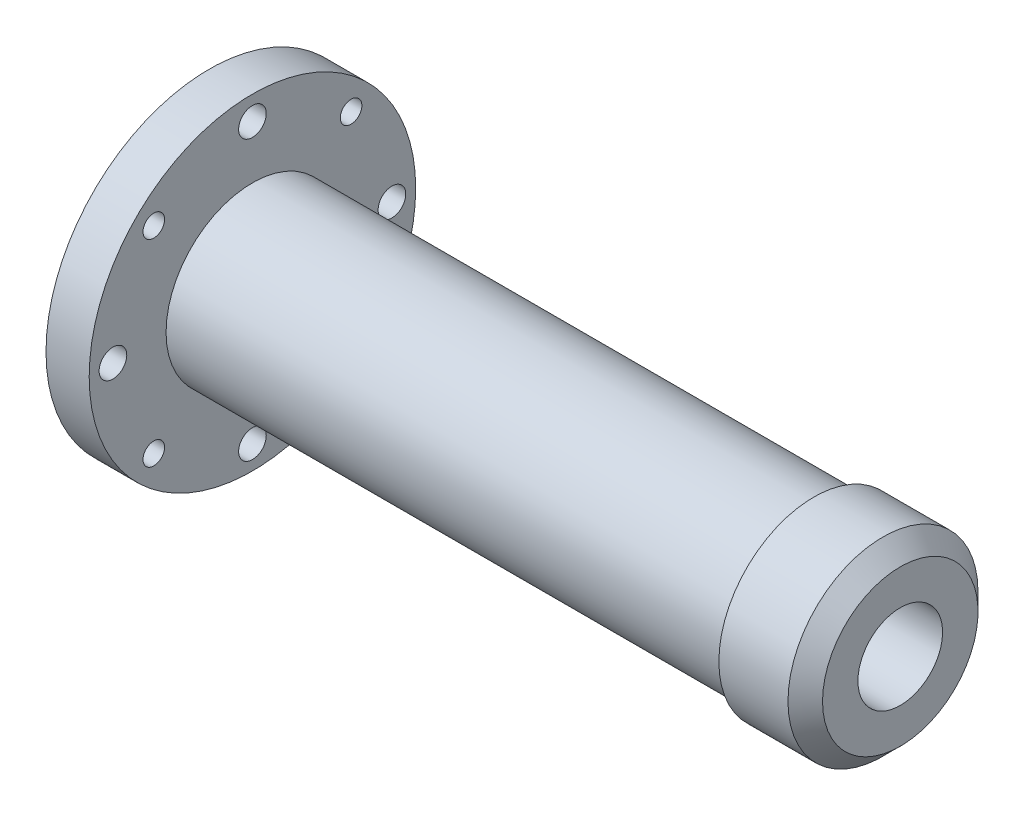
from build123d import *

# Parameters (mm, degrees)
F_3_2_3_2_DURCHMESSER_BOHRUNG1_D = 3.2
M3_GEWINDEBOHRUNG1_D             = 2.5
KREISMUSTER3_COUNT               = 4
FASE1_SIZE                       = 0.5


with BuildPart() as part:
    # Skizze1 → Rotation1 (revolve)
    with BuildSketch(Plane.XY, mode=Mode.PRIVATE) as rotation1_sk:
        Polygon((0, 5), (15, 5), (15, 4.9), (80, 4.9), (80, 9), (78, 11), (70, 11), (70, 10), (5, 10), (5, 18.9), (0, 18.9), (0, 13.5), (4.3, 13.5), (4.3, 10), (0, 10), align=None)
    revolve(rotation1_sk.sketch.rotate(Axis((0, 0, 0), (1, 0, 0)), 90), axis=Axis((0, 0, 0), (1, 0, 0)))

    # 3.2 _3.2_ Durchmesser Bohrung1 (through all)
    with Locations(Plane(origin=(5, 0, 0), x_dir=(0, 0, -1), z_dir=(1, 0, 0))):
        with Locations((16.15, 0)):
            f_3_2_3_2_durchmesser_bohrung1 = Hole(F_3_2_3_2_DURCHMESSER_BOHRUNG1_D / 2)

    # Skizze5 → M2.5 Gewindebohrung1 (revolve, cut)
    with BuildSketch(Plane.ZX.offset(7.5)):
        Polygon((0, 0), (0, 7.865882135), (1.025, 7.25), (1.025, 0), align=None)
    m2_5_gewindebohrung1 = revolve(axis=Axis((-6.35, 7.5, 0), (1, 0, 0)), mode=Mode.SUBTRACT)

    # M3 Gewindebohrung1 (through all)
    with Locations(Plane.ZY):
        with Locations((-11.419774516, 11.419774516)):
            m3_gewindebohrung1 = Hole(M3_GEWINDEBOHRUNG1_D / 2)

    # Kreismuster3: 3.2 _3.2_ Durchmesser Bohrung1, M2.5 Gewindebohrung1, M3 Gewindebohrung1 ×4 about axis
    kreismuster3_axis = Axis((0, 0, 0), (1, 0, 0))
    add([f_3_2_3_2_durchmesser_bohrung1.rotate(kreismuster3_axis, i * 360 / KREISMUSTER3_COUNT) for i in range(1, KREISMUSTER3_COUNT)], mode=Mode.SUBTRACT)
    add([m2_5_gewindebohrung1.rotate(kreismuster3_axis, i * 360 / KREISMUSTER3_COUNT) for i in range(1, KREISMUSTER3_COUNT)], mode=Mode.SUBTRACT)
    add([m3_gewindebohrung1.rotate(kreismuster3_axis, i * 360 / KREISMUSTER3_COUNT) for i in range(1, KREISMUSTER3_COUNT)], mode=Mode.SUBTRACT)

    # Fase1
    fase1_edges = [part.edges().sort_by_distance(p)[0] for p in [
        (0, 0, -5),
    ]]
    chamfer(fase1_edges, length=FASE1_SIZE)


solid = part.part
